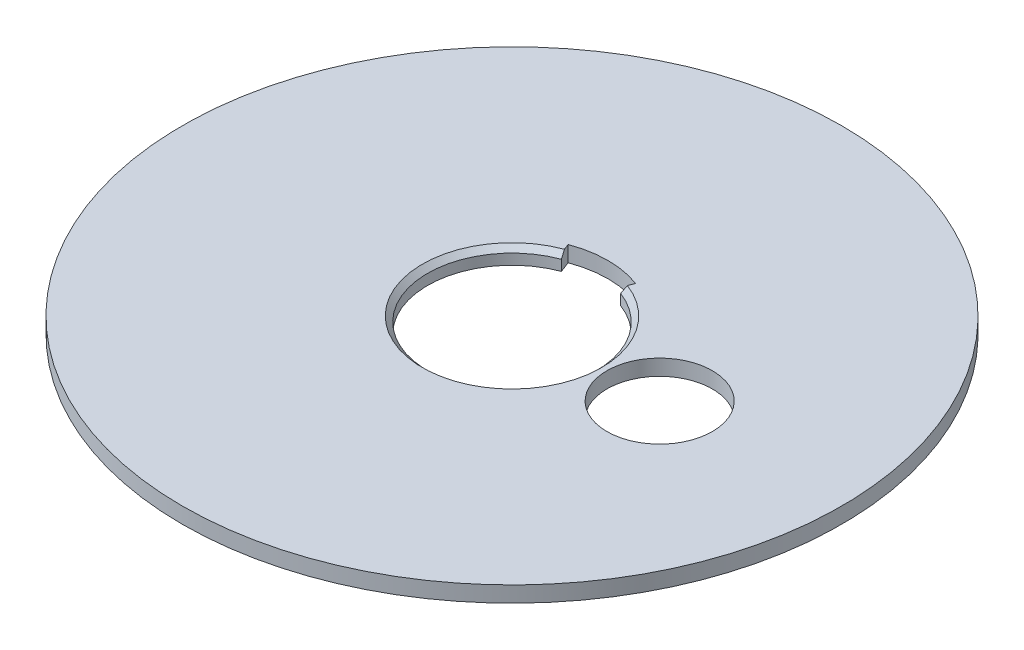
ISO-10303-21;
HEADER;
FILE_DESCRIPTION(('STEP AP214'),'2;1');
FILE_NAME('part.step','',(''),(''),'','','');
FILE_SCHEMA(('AUTOMOTIVE_DESIGN { 1 0 10303 214 1 1 1 1 }'));
ENDSEC;
DATA;
#1=APPLICATION_CONTEXT('core data for automotive mechanical design processes');
#2=APPLICATION_PROTOCOL_DEFINITION('international standard','automotive_design',2000,#1);
#3=PRODUCT_CONTEXT('',#1,'mechanical');
#4=PRODUCT('Part','Part','',(#3));
#5=PRODUCT_RELATED_PRODUCT_CATEGORY('part','',(#4));
#6=PRODUCT_DEFINITION_FORMATION('','',#4);
#7=PRODUCT_DEFINITION_CONTEXT('part definition',#1,'design');
#8=PRODUCT_DEFINITION('design','',#6,#7);
#9=PRODUCT_DEFINITION_SHAPE('','',#8);
#10=(LENGTH_UNIT() NAMED_UNIT(*) SI_UNIT(.MILLI.,.METRE.));
#11=(NAMED_UNIT(*) PLANE_ANGLE_UNIT() SI_UNIT($,.RADIAN.));
#12=(NAMED_UNIT(*) SI_UNIT($,.STERADIAN.) SOLID_ANGLE_UNIT());
#13=UNCERTAINTY_MEASURE_WITH_UNIT(LENGTH_MEASURE(1.E-05),#10,'distance_accuracy_value','');
#14=(GEOMETRIC_REPRESENTATION_CONTEXT(3) GLOBAL_UNCERTAINTY_ASSIGNED_CONTEXT((#13)) GLOBAL_UNIT_ASSIGNED_CONTEXT((#10,
#11,#12)) REPRESENTATION_CONTEXT('',''));
#15=CARTESIAN_POINT('',(0.,0.,0.));
#16=DIRECTION('',(0.,0.,1.));
#17=DIRECTION('',(1.,0.,0.));
#18=AXIS2_PLACEMENT_3D('',#15,#16,#17);
#19=CARTESIAN_POINT('',(0.,-1.5,0.));
#20=DIRECTION('',(0.,1.,0.));
#21=DIRECTION('',(0.,0.,1.));
#22=AXIS2_PLACEMENT_3D('',#19,#20,#21);
#23=CYLINDRICAL_SURFACE('',#22,31.25);
#24=CARTESIAN_POINT('',(0.,-1.5,0.));
#25=DIRECTION('',(0.,1.,0.));
#26=DIRECTION('',(0.,0.,1.));
#27=AXIS2_PLACEMENT_3D('',#24,#25,#26);
#28=CIRCLE('',#27,31.25);
#29=CARTESIAN_POINT('',(0.,-1.5,31.25));
#30=VERTEX_POINT('',#29);
#31=EDGE_CURVE('E123',#30,#30,#28,.T.);
#32=ORIENTED_EDGE('',*,*,#31,.T.);
#33=EDGE_LOOP('',(#32));
#34=FACE_BOUND('',#33,.T.);
#35=CARTESIAN_POINT('',(0.,0.,0.));
#36=DIRECTION('',(0.,1.,0.));
#37=DIRECTION('',(0.,0.,1.));
#38=AXIS2_PLACEMENT_3D('',#35,#36,#37);
#39=CIRCLE('',#38,31.25);
#40=CARTESIAN_POINT('',(0.,0.,31.25));
#41=VERTEX_POINT('',#40);
#42=EDGE_CURVE('E120',#41,#41,#39,.T.);
#43=ORIENTED_EDGE('',*,*,#42,.F.);
#44=EDGE_LOOP('',(#43));
#45=FACE_BOUND('',#44,.T.);
#46=ADVANCED_FACE('F32',(#34,#45),#23,.T.);
#47=CARTESIAN_POINT('',(0.,-1.5,0.));
#48=DIRECTION('',(0.,1.,0.));
#49=DIRECTION('',(0.,0.,1.));
#50=AXIS2_PLACEMENT_3D('',#47,#48,#49);
#51=PLANE('',#50);
#52=CARTESIAN_POINT('',(0.,-1.5,0.));
#53=DIRECTION('',(0.,1.,0.));
#54=DIRECTION('',(0.,0.,1.));
#55=AXIS2_PLACEMENT_3D('',#52,#53,#54);
#56=CIRCLE('',#55,8.);
#57=CARTESIAN_POINT('',(-2.80898753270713,-1.5,-7.49063342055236));
#58=VERTEX_POINT('',#57);
#59=CARTESIAN_POINT('',(2.80898753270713,-1.5,-7.49063342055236));
#60=VERTEX_POINT('',#59);
#61=EDGE_CURVE('E87',#58,#60,#56,.T.);
#62=ORIENTED_EDGE('',*,*,#61,.T.);
#63=DIRECTION('',(0.351123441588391,0.,-0.936329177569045));
#64=VECTOR('',#63,1.);
#65=CARTESIAN_POINT('',(3.,-1.5,-8.));
#66=LINE('',#65,#64);
#67=CARTESIAN_POINT('',(3.19522331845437,-1.5,-8.5205955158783));
#68=VERTEX_POINT('',#67);
#69=EDGE_CURVE('E80',#60,#68,#66,.T.);
#70=ORIENTED_EDGE('',*,*,#69,.T.);
#71=CARTESIAN_POINT('',(0.,-1.5,0.));
#72=DIRECTION('',(0.,1.,0.));
#73=DIRECTION('',(0.,0.,1.));
#74=AXIS2_PLACEMENT_3D('',#71,#72,#73);
#75=CIRCLE('',#74,9.1);
#76=CARTESIAN_POINT('',(-3.19522331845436,-1.5,-8.52059551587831));
#77=VERTEX_POINT('',#76);
#78=EDGE_CURVE('E91',#68,#77,#75,.T.);
#79=ORIENTED_EDGE('',*,*,#78,.T.);
#80=DIRECTION('',(0.351123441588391,0.,0.936329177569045));
#81=VECTOR('',#80,1.);
#82=CARTESIAN_POINT('',(-3.,-1.5,-8.));
#83=LINE('',#82,#81);
#84=EDGE_CURVE('E95',#77,#58,#83,.T.);
#85=ORIENTED_EDGE('',*,*,#84,.T.);
#86=EDGE_LOOP('',(#62,#70,#79,#85));
#87=FACE_BOUND('',#86,.T.);
#88=CARTESIAN_POINT('',(14.,-1.5,0.));
#89=DIRECTION('',(0.,1.,0.));
#90=DIRECTION('',(0.,0.,1.));
#91=AXIS2_PLACEMENT_3D('',#88,#89,#90);
#92=CIRCLE('',#91,5.);
#93=CARTESIAN_POINT('',(14.,-1.5,5.));
#94=VERTEX_POINT('',#93);
#95=EDGE_CURVE('E117',#94,#94,#92,.T.);
#96=ORIENTED_EDGE('',*,*,#95,.T.);
#97=EDGE_LOOP('',(#96));
#98=FACE_BOUND('',#97,.T.);
#99=ORIENTED_EDGE('',*,*,#31,.F.);
#100=EDGE_LOOP('',(#99));
#101=FACE_BOUND('',#100,.T.);
#102=ADVANCED_FACE('F98',(#87,#98,#101),#51,.F.);
#103=CARTESIAN_POINT('',(0.,0.,0.));
#104=DIRECTION('',(0.,1.,0.));
#105=DIRECTION('',(0.,0.,1.));
#106=AXIS2_PLACEMENT_3D('',#103,#104,#105);
#107=PLANE('',#106);
#108=DIRECTION('',(0.351123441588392,0.,-0.936329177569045));
#109=VECTOR('',#108,1.);
#110=CARTESIAN_POINT('',(2.80898753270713,0.,-7.49063342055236));
#111=LINE('',#110,#109);
#112=CARTESIAN_POINT('',(2.98454925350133,0.,-7.95879800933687));
#113=VERTEX_POINT('',#112);
#114=CARTESIAN_POINT('',(3.19522331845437,0.,-8.52059551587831));
#115=VERTEX_POINT('',#114);
#116=EDGE_CURVE('E82',#113,#115,#111,.T.);
#117=ORIENTED_EDGE('',*,*,#116,.F.);
#118=CARTESIAN_POINT('',(0.,0.,0.));
#119=DIRECTION('',(0.,1.,0.));
#120=DIRECTION('',(0.,0.,1.));
#121=AXIS2_PLACEMENT_3D('',#118,#119,#120);
#122=CIRCLE('',#121,8.49999999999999);
#123=CARTESIAN_POINT('',(-2.98454925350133,0.,-7.95879800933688));
#124=VERTEX_POINT('',#123);
#125=EDGE_CURVE('E40',#113,#124,#122,.F.);
#126=ORIENTED_EDGE('',*,*,#125,.T.);
#127=DIRECTION('',(0.351123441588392,0.,0.936329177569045));
#128=VECTOR('',#127,1.);
#129=CARTESIAN_POINT('',(-2.80898753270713,0.,-7.49063342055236));
#130=LINE('',#129,#128);
#131=CARTESIAN_POINT('',(-3.19522331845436,0.,-8.52059551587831));
#132=VERTEX_POINT('',#131);
#133=EDGE_CURVE('E102',#132,#124,#130,.T.);
#134=ORIENTED_EDGE('',*,*,#133,.F.);
#135=CARTESIAN_POINT('',(0.,0.,0.));
#136=DIRECTION('',(0.,1.,0.));
#137=DIRECTION('',(0.,0.,1.));
#138=AXIS2_PLACEMENT_3D('',#135,#136,#137);
#139=CIRCLE('',#138,9.1);
#140=EDGE_CURVE('E107',#115,#132,#139,.T.);
#141=ORIENTED_EDGE('',*,*,#140,.F.);
#142=EDGE_LOOP('',(#117,#126,#134,#141));
#143=FACE_BOUND('',#142,.T.);
#144=CARTESIAN_POINT('',(14.,0.,0.));
#145=DIRECTION('',(0.,1.,0.));
#146=DIRECTION('',(0.,0.,1.));
#147=AXIS2_PLACEMENT_3D('',#144,#145,#146);
#148=CIRCLE('',#147,5.);
#149=CARTESIAN_POINT('',(14.,0.,5.));
#150=VERTEX_POINT('',#149);
#151=EDGE_CURVE('E112',#150,#150,#148,.T.);
#152=ORIENTED_EDGE('',*,*,#151,.F.);
#153=EDGE_LOOP('',(#152));
#154=FACE_BOUND('',#153,.T.);
#155=ORIENTED_EDGE('',*,*,#42,.T.);
#156=EDGE_LOOP('',(#155));
#157=FACE_BOUND('',#156,.T.);
#158=ADVANCED_FACE('F138',(#143,#154,#157),#107,.T.);
#159=CARTESIAN_POINT('',(14.,-1.5,0.));
#160=DIRECTION('',(0.,1.,0.));
#161=DIRECTION('',(0.,0.,1.));
#162=AXIS2_PLACEMENT_3D('',#159,#160,#161);
#163=CYLINDRICAL_SURFACE('',#162,5.);
#164=ORIENTED_EDGE('',*,*,#95,.F.);
#165=EDGE_LOOP('',(#164));
#166=FACE_BOUND('',#165,.T.);
#167=ORIENTED_EDGE('',*,*,#151,.T.);
#168=EDGE_LOOP('',(#167));
#169=FACE_BOUND('',#168,.T.);
#170=ADVANCED_FACE('F141',(#166,#169),#163,.F.);
#171=CARTESIAN_POINT('',(2.80898753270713,-1.5,-7.49063342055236));
#172=DIRECTION('',(0.936329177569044,0.,0.351123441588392));
#173=DIRECTION('',(0.351123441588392,0.,-0.936329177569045));
#174=AXIS2_PLACEMENT_3D('',#171,#172,#173);
#175=PLANE('',#174);
#176=DIRECTION('',(0.,1.,0.));
#177=VECTOR('',#176,1.);
#178=CARTESIAN_POINT('',(2.80898753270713,-1.5,-7.49063342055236));
#179=LINE('',#178,#177);
#180=CARTESIAN_POINT('',(2.80898753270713,-0.49999999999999,-7.49063342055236));
#181=VERTEX_POINT('',#180);
#182=EDGE_CURVE('E110',#60,#181,#179,.T.);
#183=ORIENTED_EDGE('',*,*,#182,.T.);
#184=DIRECTION('',(0.24828176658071,0.707106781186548,-0.662084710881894));
#185=VECTOR('',#184,1.);
#186=CARTESIAN_POINT('',(0.,-8.49999999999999,0.));
#187=LINE('',#186,#185);
#188=EDGE_CURVE('E54',#181,#113,#187,.T.);
#189=ORIENTED_EDGE('',*,*,#188,.T.);
#190=ORIENTED_EDGE('',*,*,#116,.T.);
#191=DIRECTION('',(0.,1.,0.));
#192=VECTOR('',#191,1.);
#193=CARTESIAN_POINT('',(3.19522331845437,-1.5,-8.5205955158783));
#194=LINE('',#193,#192);
#195=EDGE_CURVE('E76',#68,#115,#194,.T.);
#196=ORIENTED_EDGE('',*,*,#195,.F.);
#197=ORIENTED_EDGE('',*,*,#69,.F.);
#198=EDGE_LOOP('',(#183,#189,#190,#196,#197));
#199=FACE_BOUND('',#198,.T.);
#200=ADVANCED_FACE('F78',(#199),#175,.F.);
#201=CARTESIAN_POINT('',(0.,-1.5,0.));
#202=DIRECTION('',(0.,1.,0.));
#203=DIRECTION('',(0.,0.,1.));
#204=AXIS2_PLACEMENT_3D('',#201,#202,#203);
#205=CYLINDRICAL_SURFACE('',#204,8.);
#206=DIRECTION('',(0.,1.,0.));
#207=VECTOR('',#206,1.);
#208=CARTESIAN_POINT('',(-2.80898753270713,-1.5,-7.49063342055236));
#209=LINE('',#208,#207);
#210=CARTESIAN_POINT('',(-2.80898753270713,-0.49999999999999,-7.49063342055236));
#211=VERTEX_POINT('',#210);
#212=EDGE_CURVE('E113',#58,#211,#209,.T.);
#213=ORIENTED_EDGE('',*,*,#212,.T.);
#214=CARTESIAN_POINT('',(0.,-0.499999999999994,0.));
#215=DIRECTION('',(0.,1.,0.));
#216=DIRECTION('',(0.,0.,1.));
#217=AXIS2_PLACEMENT_3D('',#214,#215,#216);
#218=CIRCLE('',#217,8.);
#219=EDGE_CURVE('E126',#211,#181,#218,.T.);
#220=ORIENTED_EDGE('',*,*,#219,.T.);
#221=ORIENTED_EDGE('',*,*,#182,.F.);
#222=ORIENTED_EDGE('',*,*,#61,.F.);
#223=EDGE_LOOP('',(#213,#220,#221,#222));
#224=FACE_BOUND('',#223,.T.);
#225=ADVANCED_FACE('F133',(#224),#205,.F.);
#226=CARTESIAN_POINT('',(-2.80898753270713,-1.5,-7.49063342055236));
#227=DIRECTION('',(-0.936329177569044,0.,0.351123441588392));
#228=DIRECTION('',(0.351123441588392,0.,0.936329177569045));
#229=AXIS2_PLACEMENT_3D('',#226,#227,#228);
#230=PLANE('',#229);
#231=ORIENTED_EDGE('',*,*,#133,.T.);
#232=DIRECTION('',(0.24828176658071,-0.707106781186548,0.662084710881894));
#233=VECTOR('',#232,1.);
#234=CARTESIAN_POINT('',(0.,-8.49999999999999,0.));
#235=LINE('',#234,#233);
#236=EDGE_CURVE('E11',#124,#211,#235,.T.);
#237=ORIENTED_EDGE('',*,*,#236,.T.);
#238=ORIENTED_EDGE('',*,*,#212,.F.);
#239=ORIENTED_EDGE('',*,*,#84,.F.);
#240=DIRECTION('',(0.,1.,0.));
#241=VECTOR('',#240,1.);
#242=CARTESIAN_POINT('',(-3.19522331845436,-1.5,-8.52059551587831));
#243=LINE('',#242,#241);
#244=EDGE_CURVE('E86',#77,#132,#243,.T.);
#245=ORIENTED_EDGE('',*,*,#244,.T.);
#246=EDGE_LOOP('',(#231,#237,#238,#239,#245));
#247=FACE_BOUND('',#246,.T.);
#248=ADVANCED_FACE('F137',(#247),#230,.F.);
#249=CARTESIAN_POINT('',(0.,-1.5,0.));
#250=DIRECTION('',(0.,1.,0.));
#251=DIRECTION('',(0.,0.,1.));
#252=AXIS2_PLACEMENT_3D('',#249,#250,#251);
#253=CYLINDRICAL_SURFACE('',#252,9.1);
#254=ORIENTED_EDGE('',*,*,#140,.T.);
#255=ORIENTED_EDGE('',*,*,#244,.F.);
#256=ORIENTED_EDGE('',*,*,#78,.F.);
#257=ORIENTED_EDGE('',*,*,#195,.T.);
#258=EDGE_LOOP('',(#254,#255,#256,#257));
#259=FACE_BOUND('',#258,.T.);
#260=ADVANCED_FACE('F92',(#259),#253,.F.);
#261=CARTESIAN_POINT('',(0.,-0.499999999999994,0.));
#262=DIRECTION('',(0.,1.,0.));
#263=DIRECTION('',(0.,0.,1.));
#264=AXIS2_PLACEMENT_3D('',#261,#262,#263);
#265=CONICAL_SURFACE('',#264,8.,0.785398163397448);
#266=ORIENTED_EDGE('',*,*,#236,.F.);
#267=ORIENTED_EDGE('',*,*,#125,.F.);
#268=ORIENTED_EDGE('',*,*,#188,.F.);
#269=ORIENTED_EDGE('',*,*,#219,.F.);
#270=EDGE_LOOP('',(#266,#267,#268,#269));
#271=FACE_BOUND('',#270,.T.);
#272=ADVANCED_FACE('F34',(#271),#265,.F.);
#273=CLOSED_SHELL('',(#46,#102,#158,#170,#200,#225,#248,#260,#272));
#274=MANIFOLD_SOLID_BREP('B2',#273);
#275=ADVANCED_BREP_SHAPE_REPRESENTATION('',(#18,#274),#14);
#276=SHAPE_DEFINITION_REPRESENTATION(#9,#275);
ENDSEC;
END-ISO-10303-21;
